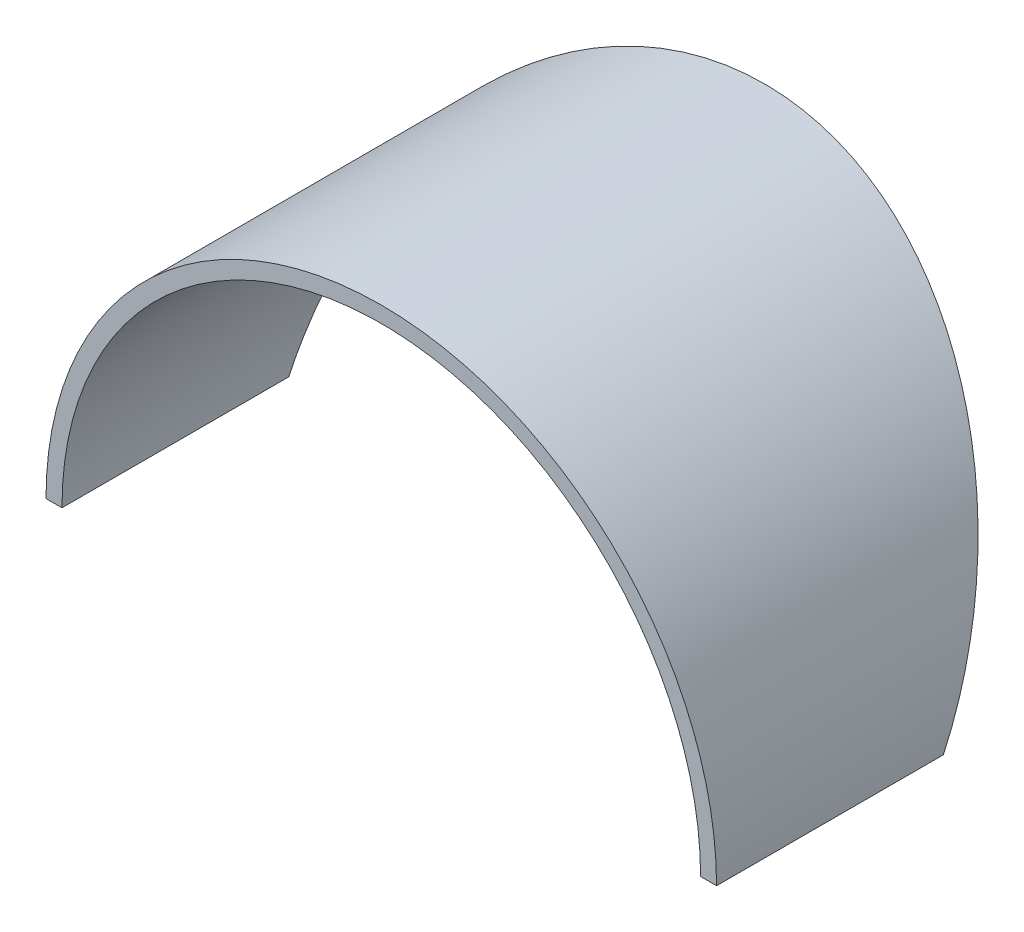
from build123d import *

# Parameters (mm, degrees)
BOSS_EXTRUDE1_DEPTH = 76.2
CUT_EXTRUDE1_DEPTH  = 267.783020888


with BuildPart() as part:
    # Sketch1 → Boss-Extrude1 (new body)
    with BuildSketch(Plane.XY):
        with BuildLine():
            Line((-55.372, 109.22), (-52.197, 109.22))
            ThreePointArc((-52.197, 109.22), (-118.872, 175.895), (-185.547, 109.22))
            Line((-185.547, 109.22), (-182.372, 109.22))
            ThreePointArc((-182.372, 109.22), (-118.872, 172.72), (-55.372, 109.22))
        make_face()
    extrude(amount=BOSS_EXTRUDE1_DEPTH)

    # Sketch2 → Cut-Extrude1 (cut, through all)
    with BuildSketch(Plane(origin=(0, 0, 0), x_dir=(0, 0, -1), z_dir=(1, 0, 0))):
        Polygon((-31.091063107, 109.22), (0, 175.895), (0, 109.22), align=None)
    extrude(amount=-CUT_EXTRUDE1_DEPTH, mode=Mode.SUBTRACT)


solid = part.part
